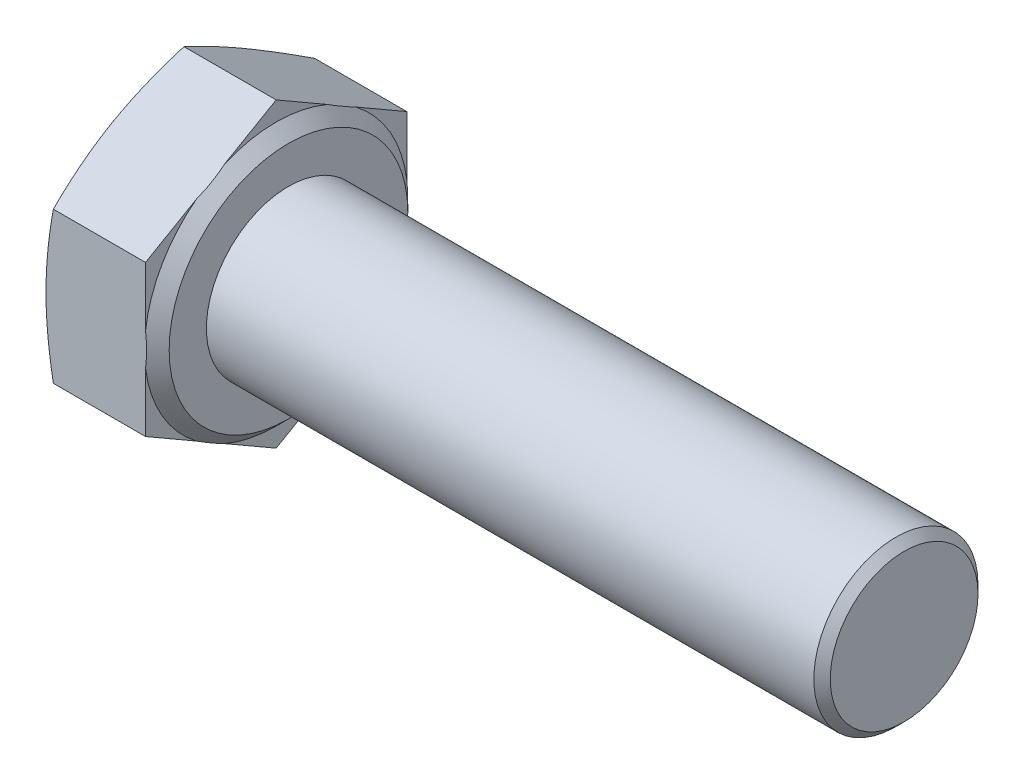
from build123d import *

# Parameters (mm, degrees)
BASEHEAD_DEPTH = 5.45
SKETCH5_R      = 4
BASEBODY_DEPTH = 30
CHAMFER1_SIZE  = 0.4


with BuildPart() as part:
    # Sketch2 → BaseHead (new body)
    with BuildSketch(Plane(origin=(0, 0, 0), x_dir=(0, 0, -1), z_dir=(1, 0, 0))):
        Polygon((6.365, -3.674834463), (6.365, 3.674834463), (0, 7.349668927), (-6.365, 3.674834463), (-6.365, -3.674834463), (0, -7.349668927), align=None)
    extrude(amount=BASEHEAD_DEPTH)

    # Sketch3 → BearingFace (revolve, cut)
    with BuildSketch(Plane.XY, mode=Mode.PRIVATE) as bearingface_sk:
        Polygon((5.45, 7.349668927), (5.45, 5.815), (4.85, 6.415), (4.85, 7.349668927), align=None)
    revolve(bearingface_sk.sketch.rotate(Axis((-0.957090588, 0, 0), (1, 0, 0)), 90), axis=Axis((-0.957090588, 0, 0), (1, 0, 0)), mode=Mode.SUBTRACT)

    # Sketch4 → HeadChamfer (revolve, cut)
    with BuildSketch(Plane.XY):
        Polygon((0, 7.349668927), (0.35839018, 7.349668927), (0, 6.365), align=None)
    revolve(axis=Axis((-0.493528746, 0, 0), (1, 0, 0)), mode=Mode.SUBTRACT)

    # Sketch5 → BaseBody (add)
    with BuildSketch(Plane(origin=(5.45, 0, 0), x_dir=(0, 0, -1), z_dir=(1, 0, 0))):
        Circle(SKETCH5_R)
    extrude(amount=BASEBODY_DEPTH)

    # Chamfer1
    chamfer1_edges = [part.edges().sort_by_distance(p)[0] for p in [
        (35.45, 0, 4),
    ]]
    chamfer(chamfer1_edges, length=CHAMFER1_SIZE)


solid = part.part
